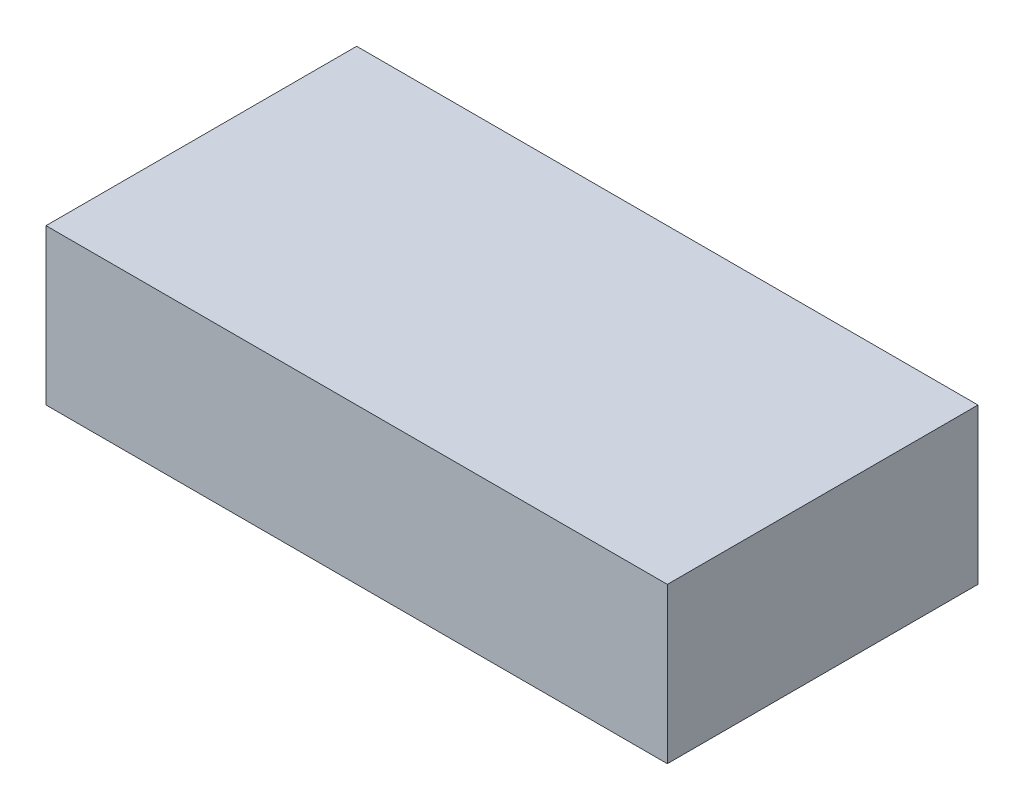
ISO-10303-21;
HEADER;
FILE_DESCRIPTION(('STEP AP214'),'2;1');
FILE_NAME('part.step','',(''),(''),'','','');
FILE_SCHEMA(('AUTOMOTIVE_DESIGN { 1 0 10303 214 1 1 1 1 }'));
ENDSEC;
DATA;
#1=APPLICATION_CONTEXT('core data for automotive mechanical design processes');
#2=APPLICATION_PROTOCOL_DEFINITION('international standard','automotive_design',2000,#1);
#3=PRODUCT_CONTEXT('',#1,'mechanical');
#4=PRODUCT('Part','Part','',(#3));
#5=PRODUCT_RELATED_PRODUCT_CATEGORY('part','',(#4));
#6=PRODUCT_DEFINITION_FORMATION('','',#4);
#7=PRODUCT_DEFINITION_CONTEXT('part definition',#1,'design');
#8=PRODUCT_DEFINITION('design','',#6,#7);
#9=PRODUCT_DEFINITION_SHAPE('','',#8);
#10=(LENGTH_UNIT() NAMED_UNIT(*) SI_UNIT(.MILLI.,.METRE.));
#11=(NAMED_UNIT(*) PLANE_ANGLE_UNIT() SI_UNIT($,.RADIAN.));
#12=(NAMED_UNIT(*) SI_UNIT($,.STERADIAN.) SOLID_ANGLE_UNIT());
#13=UNCERTAINTY_MEASURE_WITH_UNIT(LENGTH_MEASURE(1.E-05),#10,'distance_accuracy_value','');
#14=(GEOMETRIC_REPRESENTATION_CONTEXT(3) GLOBAL_UNCERTAINTY_ASSIGNED_CONTEXT((#13)) GLOBAL_UNIT_ASSIGNED_CONTEXT((#10,
#11,#12)) REPRESENTATION_CONTEXT('',''));
#15=CARTESIAN_POINT('',(0.,0.,0.));
#16=DIRECTION('',(0.,0.,1.));
#17=DIRECTION('',(1.,0.,0.));
#18=AXIS2_PLACEMENT_3D('',#15,#16,#17);
#19=CARTESIAN_POINT('',(-19.05,-4.76249999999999,19.05));
#20=DIRECTION('',(1.,0.,0.));
#21=DIRECTION('',(0.,0.,-1.));
#22=AXIS2_PLACEMENT_3D('',#19,#20,#21);
#23=PLANE('',#22);
#24=DIRECTION('',(0.,-1.,0.));
#25=VECTOR('',#24,1.);
#26=CARTESIAN_POINT('',(-19.05,-4.76249999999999,0.));
#27=LINE('',#26,#25);
#28=CARTESIAN_POINT('',(-19.05,4.76250000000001,0.));
#29=VERTEX_POINT('',#28);
#30=CARTESIAN_POINT('',(-19.05,-4.76249999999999,0.));
#31=VERTEX_POINT('',#30);
#32=EDGE_CURVE('E98',#29,#31,#27,.T.);
#33=ORIENTED_EDGE('',*,*,#32,.T.);
#34=DIRECTION('',(0.,0.,-1.));
#35=VECTOR('',#34,1.);
#36=CARTESIAN_POINT('',(-19.05,-4.76249999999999,19.05));
#37=LINE('',#36,#35);
#38=CARTESIAN_POINT('',(-19.05,-4.76249999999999,19.05));
#39=VERTEX_POINT('',#38);
#40=EDGE_CURVE('E11',#39,#31,#37,.T.);
#41=ORIENTED_EDGE('',*,*,#40,.F.);
#42=DIRECTION('',(0.,-1.,0.));
#43=VECTOR('',#42,1.);
#44=CARTESIAN_POINT('',(-19.05,-4.76249999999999,19.05));
#45=LINE('',#44,#43);
#46=CARTESIAN_POINT('',(-19.05,4.76250000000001,19.05));
#47=VERTEX_POINT('',#46);
#48=EDGE_CURVE('E86',#47,#39,#45,.T.);
#49=ORIENTED_EDGE('',*,*,#48,.F.);
#50=DIRECTION('',(0.,0.,-1.));
#51=VECTOR('',#50,1.);
#52=CARTESIAN_POINT('',(-19.05,4.76250000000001,19.05));
#53=LINE('',#52,#51);
#54=EDGE_CURVE('E94',#47,#29,#53,.T.);
#55=ORIENTED_EDGE('',*,*,#54,.T.);
#56=EDGE_LOOP('',(#33,#41,#49,#55));
#57=FACE_BOUND('',#56,.T.);
#58=ADVANCED_FACE('F35',(#57),#23,.F.);
#59=CARTESIAN_POINT('',(19.05,-4.76249999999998,19.05));
#60=DIRECTION('',(0.,1.,0.));
#61=DIRECTION('',(-1.,0.,0.));
#62=AXIS2_PLACEMENT_3D('',#59,#60,#61);
#63=PLANE('',#62);
#64=DIRECTION('',(1.,0.,0.));
#65=VECTOR('',#64,1.);
#66=CARTESIAN_POINT('',(19.05,-4.76249999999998,0.));
#67=LINE('',#66,#65);
#68=CARTESIAN_POINT('',(19.05,-4.76249999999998,0.));
#69=VERTEX_POINT('',#68);
#70=EDGE_CURVE('E90',#31,#69,#67,.T.);
#71=ORIENTED_EDGE('',*,*,#70,.T.);
#72=DIRECTION('',(0.,0.,-1.));
#73=VECTOR('',#72,1.);
#74=CARTESIAN_POINT('',(19.05,-4.76249999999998,19.05));
#75=LINE('',#74,#73);
#76=CARTESIAN_POINT('',(19.05,-4.76249999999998,19.05));
#77=VERTEX_POINT('',#76);
#78=EDGE_CURVE('E43',#77,#69,#75,.T.);
#79=ORIENTED_EDGE('',*,*,#78,.F.);
#80=DIRECTION('',(1.,0.,0.));
#81=VECTOR('',#80,1.);
#82=CARTESIAN_POINT('',(19.05,-4.76249999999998,19.05));
#83=LINE('',#82,#81);
#84=EDGE_CURVE('E81',#39,#77,#83,.T.);
#85=ORIENTED_EDGE('',*,*,#84,.F.);
#86=ORIENTED_EDGE('',*,*,#40,.T.);
#87=EDGE_LOOP('',(#71,#79,#85,#86));
#88=FACE_BOUND('',#87,.T.);
#89=ADVANCED_FACE('F89',(#88),#63,.F.);
#90=CARTESIAN_POINT('',(19.05,-4.76249999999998,19.05));
#91=DIRECTION('',(-1.,0.,0.));
#92=DIRECTION('',(0.,0.,1.));
#93=AXIS2_PLACEMENT_3D('',#90,#91,#92);
#94=PLANE('',#93);
#95=DIRECTION('',(0.,1.,0.));
#96=VECTOR('',#95,1.);
#97=CARTESIAN_POINT('',(19.05,-4.76249999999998,0.));
#98=LINE('',#97,#96);
#99=CARTESIAN_POINT('',(19.05,4.76250000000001,0.));
#100=VERTEX_POINT('',#99);
#101=EDGE_CURVE('E68',#69,#100,#98,.T.);
#102=ORIENTED_EDGE('',*,*,#101,.T.);
#103=DIRECTION('',(0.,0.,-1.));
#104=VECTOR('',#103,1.);
#105=CARTESIAN_POINT('',(19.05,4.76250000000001,19.05));
#106=LINE('',#105,#104);
#107=CARTESIAN_POINT('',(19.05,4.76250000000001,19.05));
#108=VERTEX_POINT('',#107);
#109=EDGE_CURVE('E91',#108,#100,#106,.T.);
#110=ORIENTED_EDGE('',*,*,#109,.F.);
#111=DIRECTION('',(0.,1.,0.));
#112=VECTOR('',#111,1.);
#113=CARTESIAN_POINT('',(19.05,-4.76249999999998,19.05));
#114=LINE('',#113,#112);
#115=EDGE_CURVE('E84',#77,#108,#114,.T.);
#116=ORIENTED_EDGE('',*,*,#115,.F.);
#117=ORIENTED_EDGE('',*,*,#78,.T.);
#118=EDGE_LOOP('',(#102,#110,#116,#117));
#119=FACE_BOUND('',#118,.T.);
#120=ADVANCED_FACE('F92',(#119),#94,.F.);
#121=CARTESIAN_POINT('',(19.05,4.76250000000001,19.05));
#122=DIRECTION('',(0.,-1.,0.));
#123=DIRECTION('',(1.,0.,0.));
#124=AXIS2_PLACEMENT_3D('',#121,#122,#123);
#125=PLANE('',#124);
#126=DIRECTION('',(-1.,0.,0.));
#127=VECTOR('',#126,1.);
#128=CARTESIAN_POINT('',(19.05,4.76250000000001,0.));
#129=LINE('',#128,#127);
#130=EDGE_CURVE('E74',#100,#29,#129,.T.);
#131=ORIENTED_EDGE('',*,*,#130,.T.);
#132=ORIENTED_EDGE('',*,*,#54,.F.);
#133=DIRECTION('',(-1.,0.,0.));
#134=VECTOR('',#133,1.);
#135=CARTESIAN_POINT('',(19.05,4.76250000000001,19.05));
#136=LINE('',#135,#134);
#137=EDGE_CURVE('E51',#108,#47,#136,.T.);
#138=ORIENTED_EDGE('',*,*,#137,.F.);
#139=ORIENTED_EDGE('',*,*,#109,.T.);
#140=EDGE_LOOP('',(#131,#132,#138,#139));
#141=FACE_BOUND('',#140,.T.);
#142=ADVANCED_FACE('F105',(#141),#125,.F.);
#143=CARTESIAN_POINT('',(0.,0.,19.05));
#144=DIRECTION('',(0.,0.,1.));
#145=DIRECTION('',(1.,0.,0.));
#146=AXIS2_PLACEMENT_3D('',#143,#144,#145);
#147=PLANE('',#146);
#148=ORIENTED_EDGE('',*,*,#48,.T.);
#149=ORIENTED_EDGE('',*,*,#84,.T.);
#150=ORIENTED_EDGE('',*,*,#115,.T.);
#151=ORIENTED_EDGE('',*,*,#137,.T.);
#152=EDGE_LOOP('',(#148,#149,#150,#151));
#153=FACE_BOUND('',#152,.T.);
#154=ADVANCED_FACE('F82',(#153),#147,.T.);
#155=CARTESIAN_POINT('',(0.,0.,0.));
#156=DIRECTION('',(0.,0.,1.));
#157=DIRECTION('',(1.,0.,0.));
#158=AXIS2_PLACEMENT_3D('',#155,#156,#157);
#159=PLANE('',#158);
#160=ORIENTED_EDGE('',*,*,#32,.F.);
#161=ORIENTED_EDGE('',*,*,#130,.F.);
#162=ORIENTED_EDGE('',*,*,#101,.F.);
#163=ORIENTED_EDGE('',*,*,#70,.F.);
#164=EDGE_LOOP('',(#160,#161,#162,#163));
#165=FACE_BOUND('',#164,.T.);
#166=ADVANCED_FACE('F108',(#165),#159,.F.);
#167=CLOSED_SHELL('',(#58,#89,#120,#142,#154,#166));
#168=MANIFOLD_SOLID_BREP('B2',#167);
#169=ADVANCED_BREP_SHAPE_REPRESENTATION('',(#18,#168),#14);
#170=SHAPE_DEFINITION_REPRESENTATION(#9,#169);
ENDSEC;
END-ISO-10303-21;
